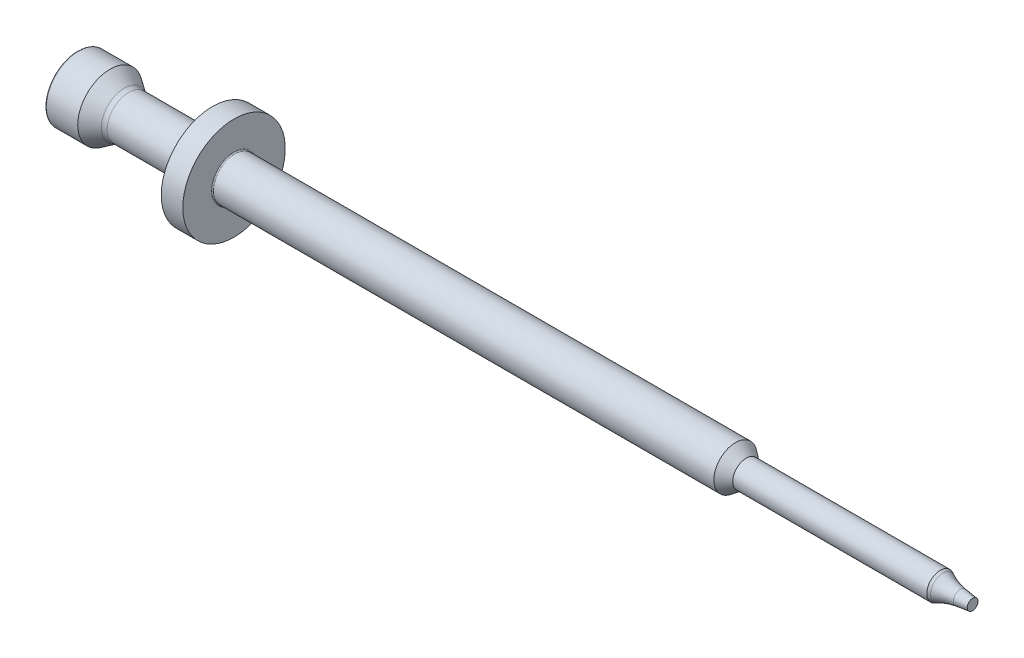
ISO-10303-21;
HEADER;
FILE_DESCRIPTION(('STEP AP214'),'2;1');
FILE_NAME('part.step','',(''),(''),'','','');
FILE_SCHEMA(('AUTOMOTIVE_DESIGN { 1 0 10303 214 1 1 1 1 }'));
ENDSEC;
DATA;
#1=APPLICATION_CONTEXT('core data for automotive mechanical design processes');
#2=APPLICATION_PROTOCOL_DEFINITION('international standard','automotive_design',2000,#1);
#3=PRODUCT_CONTEXT('',#1,'mechanical');
#4=PRODUCT('Part','Part','',(#3));
#5=PRODUCT_RELATED_PRODUCT_CATEGORY('part','',(#4));
#6=PRODUCT_DEFINITION_FORMATION('','',#4);
#7=PRODUCT_DEFINITION_CONTEXT('part definition',#1,'design');
#8=PRODUCT_DEFINITION('design','',#6,#7);
#9=PRODUCT_DEFINITION_SHAPE('','',#8);
#10=(LENGTH_UNIT() NAMED_UNIT(*) SI_UNIT(.MILLI.,.METRE.));
#11=(NAMED_UNIT(*) PLANE_ANGLE_UNIT() SI_UNIT($,.RADIAN.));
#12=(NAMED_UNIT(*) SI_UNIT($,.STERADIAN.) SOLID_ANGLE_UNIT());
#13=UNCERTAINTY_MEASURE_WITH_UNIT(LENGTH_MEASURE(1.E-05),#10,'distance_accuracy_value','');
#14=(GEOMETRIC_REPRESENTATION_CONTEXT(3) GLOBAL_UNCERTAINTY_ASSIGNED_CONTEXT((#13)) GLOBAL_UNIT_ASSIGNED_CONTEXT((#10,
#11,#12)) REPRESENTATION_CONTEXT('',''));
#15=CARTESIAN_POINT('',(0.,0.,0.));
#16=DIRECTION('',(0.,0.,1.));
#17=DIRECTION('',(1.,0.,0.));
#18=AXIS2_PLACEMENT_3D('',#15,#16,#17);
#19=CARTESIAN_POINT('',(0.,0.,0.));
#20=DIRECTION('',(1.,0.,0.));
#21=DIRECTION('',(0.,0.,-1.));
#22=AXIS2_PLACEMENT_3D('',#19,#20,#21);
#23=PLANE('',#22);
#24=CARTESIAN_POINT('',(0.,0.,0.));
#25=DIRECTION('',(1.,0.,0.));
#26=DIRECTION('',(0.,0.,-1.));
#27=AXIS2_PLACEMENT_3D('',#24,#25,#26);
#28=CIRCLE('',#27,2.9);
#29=CARTESIAN_POINT('',(0.,0.,-2.9));
#30=VERTEX_POINT('',#29);
#31=EDGE_CURVE('E35',#30,#30,#28,.F.);
#32=ORIENTED_EDGE('',*,*,#31,.T.);
#33=EDGE_LOOP('',(#32));
#34=FACE_BOUND('',#33,.T.);
#35=ADVANCED_FACE('F28',(#34),#23,.F.);
#36=CARTESIAN_POINT('',(0.,0.,0.));
#37=DIRECTION('',(-1.,0.,0.));
#38=DIRECTION('',(0.,0.,1.));
#39=AXIS2_PLACEMENT_3D('',#36,#37,#38);
#40=CYLINDRICAL_SURFACE('',#39,3.);
#41=CARTESIAN_POINT('',(0.1,0.,0.));
#42=DIRECTION('',(1.,0.,0.));
#43=DIRECTION('',(0.,0.,-1.));
#44=AXIS2_PLACEMENT_3D('',#41,#42,#43);
#45=CIRCLE('',#44,3.);
#46=CARTESIAN_POINT('',(0.1,0.,-3.));
#47=VERTEX_POINT('',#46);
#48=EDGE_CURVE('E10',#47,#47,#45,.T.);
#49=ORIENTED_EDGE('',*,*,#48,.T.);
#50=EDGE_LOOP('',(#49));
#51=FACE_BOUND('',#50,.T.);
#52=CARTESIAN_POINT('',(3.,0.,0.));
#53=DIRECTION('',(-1.,0.,0.));
#54=DIRECTION('',(0.,0.,1.));
#55=AXIS2_PLACEMENT_3D('',#52,#53,#54);
#56=CIRCLE('',#55,3.);
#57=CARTESIAN_POINT('',(3.,0.,3.));
#58=VERTEX_POINT('',#57);
#59=EDGE_CURVE('E66',#58,#58,#56,.T.);
#60=ORIENTED_EDGE('',*,*,#59,.T.);
#61=EDGE_LOOP('',(#60));
#62=FACE_BOUND('',#61,.T.);
#63=ADVANCED_FACE('F105',(#51,#62),#40,.T.);
#64=CARTESIAN_POINT('',(4.5,0.,0.));
#65=DIRECTION('',(-1.,0.,0.));
#66=DIRECTION('',(0.,0.,1.));
#67=AXIS2_PLACEMENT_3D('',#64,#65,#66);
#68=CONICAL_SURFACE('',#67,2.,0.588002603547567);
#69=CARTESIAN_POINT('',(4.31105658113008,0.,0.));
#70=DIRECTION('',(-1.,0.,0.));
#71=DIRECTION('',(0.,0.,1.));
#72=AXIS2_PLACEMENT_3D('',#69,#70,#71);
#73=CIRCLE('',#72,2.12596227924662);
#74=CARTESIAN_POINT('',(4.31105658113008,0.,2.12596227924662));
#75=VERTEX_POINT('',#74);
#76=EDGE_CURVE('E43',#75,#75,#73,.T.);
#77=ORIENTED_EDGE('',*,*,#76,.T.);
#78=EDGE_LOOP('',(#77));
#79=FACE_BOUND('',#78,.T.);
#80=ORIENTED_EDGE('',*,*,#59,.F.);
#81=EDGE_LOOP('',(#80));
#82=FACE_BOUND('',#81,.T.);
#83=ADVANCED_FACE('F110',(#79,#82),#68,.T.);
#84=CARTESIAN_POINT('',(0.,0.,0.));
#85=DIRECTION('',(-1.,0.,0.));
#86=DIRECTION('',(0.,0.,1.));
#87=AXIS2_PLACEMENT_3D('',#84,#85,#86);
#88=CYLINDRICAL_SURFACE('',#87,2.);
#89=CARTESIAN_POINT('',(4.727081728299,0.,0.));
#90=DIRECTION('',(-1.,0.,0.));
#91=DIRECTION('',(0.,0.,1.));
#92=AXIS2_PLACEMENT_3D('',#89,#90,#91);
#93=CIRCLE('',#92,2.);
#94=CARTESIAN_POINT('',(4.727081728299,0.,2.));
#95=VERTEX_POINT('',#94);
#96=EDGE_CURVE('E39',#95,#95,#93,.F.);
#97=ORIENTED_EDGE('',*,*,#96,.T.);
#98=EDGE_LOOP('',(#97));
#99=FACE_BOUND('',#98,.T.);
#100=CARTESIAN_POINT('',(11.75,0.,0.));
#101=DIRECTION('',(1.,0.,0.));
#102=DIRECTION('',(0.,0.,-1.));
#103=AXIS2_PLACEMENT_3D('',#100,#101,#102);
#104=CIRCLE('',#103,2.);
#105=CARTESIAN_POINT('',(11.75,0.,-2.));
#106=VERTEX_POINT('',#105);
#107=EDGE_CURVE('E51',#106,#106,#104,.F.);
#108=ORIENTED_EDGE('',*,*,#107,.T.);
#109=EDGE_LOOP('',(#108));
#110=FACE_BOUND('',#109,.T.);
#111=ADVANCED_FACE('F133',(#99,#110),#88,.T.);
#112=CARTESIAN_POINT('',(12.5,-2.,0.));
#113=DIRECTION('',(1.,0.,0.));
#114=DIRECTION('',(0.,0.,-1.));
#115=AXIS2_PLACEMENT_3D('',#112,#113,#114);
#116=PLANE('',#115);
#117=CARTESIAN_POINT('',(12.5,0.,0.));
#118=DIRECTION('',(1.,0.,0.));
#119=DIRECTION('',(0.,0.,-1.));
#120=AXIS2_PLACEMENT_3D('',#117,#118,#119);
#121=CIRCLE('',#120,2.75);
#122=CARTESIAN_POINT('',(12.5,0.,-2.75));
#123=VERTEX_POINT('',#122);
#124=EDGE_CURVE('E48',#123,#123,#121,.T.);
#125=ORIENTED_EDGE('',*,*,#124,.T.);
#126=EDGE_LOOP('',(#125));
#127=FACE_BOUND('',#126,.T.);
#128=CARTESIAN_POINT('',(12.5,0.,0.));
#129=DIRECTION('',(-1.,0.,0.));
#130=DIRECTION('',(0.,0.,1.));
#131=AXIS2_PLACEMENT_3D('',#128,#129,#130);
#132=CIRCLE('',#131,4.75);
#133=CARTESIAN_POINT('',(12.5,0.,4.75));
#134=VERTEX_POINT('',#133);
#135=EDGE_CURVE('E69',#134,#134,#132,.T.);
#136=ORIENTED_EDGE('',*,*,#135,.T.);
#137=EDGE_LOOP('',(#136));
#138=FACE_BOUND('',#137,.T.);
#139=ADVANCED_FACE('F139',(#127,#138),#116,.F.);
#140=CARTESIAN_POINT('',(0.,0.,0.));
#141=DIRECTION('',(-1.,0.,0.));
#142=DIRECTION('',(0.,0.,1.));
#143=AXIS2_PLACEMENT_3D('',#140,#141,#142);
#144=CYLINDRICAL_SURFACE('',#143,4.75);
#145=ORIENTED_EDGE('',*,*,#135,.F.);
#146=EDGE_LOOP('',(#145));
#147=FACE_BOUND('',#146,.T.);
#148=CARTESIAN_POINT('',(14.5,0.,0.));
#149=DIRECTION('',(-1.,0.,0.));
#150=DIRECTION('',(0.,0.,1.));
#151=AXIS2_PLACEMENT_3D('',#148,#149,#150);
#152=CIRCLE('',#151,4.75);
#153=CARTESIAN_POINT('',(14.5,0.,4.75));
#154=VERTEX_POINT('',#153);
#155=EDGE_CURVE('E72',#154,#154,#152,.T.);
#156=ORIENTED_EDGE('',*,*,#155,.T.);
#157=EDGE_LOOP('',(#156));
#158=FACE_BOUND('',#157,.T.);
#159=ADVANCED_FACE('F145',(#147,#158),#144,.T.);
#160=CARTESIAN_POINT('',(14.5,-4.75,0.));
#161=DIRECTION('',(-1.,0.,0.));
#162=DIRECTION('',(0.,0.,1.));
#163=AXIS2_PLACEMENT_3D('',#160,#161,#162);
#164=PLANE('',#163);
#165=CARTESIAN_POINT('',(14.5,0.,0.));
#166=DIRECTION('',(-1.,0.,0.));
#167=DIRECTION('',(0.,0.,1.));
#168=AXIS2_PLACEMENT_3D('',#165,#166,#167);
#169=CIRCLE('',#168,2.1);
#170=CARTESIAN_POINT('',(14.5,0.,2.1));
#171=VERTEX_POINT('',#170);
#172=EDGE_CURVE('E57',#171,#171,#169,.T.);
#173=ORIENTED_EDGE('',*,*,#172,.T.);
#174=EDGE_LOOP('',(#173));
#175=FACE_BOUND('',#174,.T.);
#176=ORIENTED_EDGE('',*,*,#155,.F.);
#177=EDGE_LOOP('',(#176));
#178=FACE_BOUND('',#177,.T.);
#179=ADVANCED_FACE('F149',(#175,#178),#164,.F.);
#180=CARTESIAN_POINT('',(0.,0.,0.));
#181=DIRECTION('',(-1.,0.,0.));
#182=DIRECTION('',(0.,0.,1.));
#183=AXIS2_PLACEMENT_3D('',#180,#181,#182);
#184=CYLINDRICAL_SURFACE('',#183,2.);
#185=CARTESIAN_POINT('',(14.6,0.,0.));
#186=DIRECTION('',(-1.,0.,0.));
#187=DIRECTION('',(0.,0.,1.));
#188=AXIS2_PLACEMENT_3D('',#185,#186,#187);
#189=CIRCLE('',#188,2.);
#190=CARTESIAN_POINT('',(14.6,0.,2.));
#191=VERTEX_POINT('',#190);
#192=EDGE_CURVE('E54',#191,#191,#189,.F.);
#193=ORIENTED_EDGE('',*,*,#192,.T.);
#194=EDGE_LOOP('',(#193));
#195=FACE_BOUND('',#194,.T.);
#196=CARTESIAN_POINT('',(61.,0.,0.));
#197=DIRECTION('',(-1.,0.,0.));
#198=DIRECTION('',(0.,0.,1.));
#199=AXIS2_PLACEMENT_3D('',#196,#197,#198);
#200=CIRCLE('',#199,2.);
#201=CARTESIAN_POINT('',(61.,0.,2.));
#202=VERTEX_POINT('',#201);
#203=EDGE_CURVE('E75',#202,#202,#200,.T.);
#204=ORIENTED_EDGE('',*,*,#203,.T.);
#205=EDGE_LOOP('',(#204));
#206=FACE_BOUND('',#205,.T.);
#207=ADVANCED_FACE('F153',(#195,#206),#184,.T.);
#208=CARTESIAN_POINT('',(62.,0.,0.));
#209=DIRECTION('',(-1.,0.,0.));
#210=DIRECTION('',(0.,0.,1.));
#211=AXIS2_PLACEMENT_3D('',#208,#209,#210);
#212=CONICAL_SURFACE('',#211,1.25,0.643501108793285);
#213=ORIENTED_EDGE('',*,*,#203,.F.);
#214=EDGE_LOOP('',(#213));
#215=FACE_BOUND('',#214,.T.);
#216=CARTESIAN_POINT('',(62.,0.,0.));
#217=DIRECTION('',(-1.,0.,0.));
#218=DIRECTION('',(0.,0.,1.));
#219=AXIS2_PLACEMENT_3D('',#216,#217,#218);
#220=CIRCLE('',#219,1.25);
#221=CARTESIAN_POINT('',(62.,0.,1.25));
#222=VERTEX_POINT('',#221);
#223=EDGE_CURVE('E78',#222,#222,#220,.T.);
#224=ORIENTED_EDGE('',*,*,#223,.T.);
#225=EDGE_LOOP('',(#224));
#226=FACE_BOUND('',#225,.T.);
#227=ADVANCED_FACE('F157',(#215,#226),#212,.T.);
#228=CARTESIAN_POINT('',(0.,0.,0.));
#229=DIRECTION('',(-1.,0.,0.));
#230=DIRECTION('',(0.,0.,1.));
#231=AXIS2_PLACEMENT_3D('',#228,#229,#230);
#232=CYLINDRICAL_SURFACE('',#231,1.25);
#233=ORIENTED_EDGE('',*,*,#223,.F.);
#234=EDGE_LOOP('',(#233));
#235=FACE_BOUND('',#234,.T.);
#236=CARTESIAN_POINT('',(80.,0.,0.));
#237=DIRECTION('',(-1.,0.,0.));
#238=DIRECTION('',(0.,0.,1.));
#239=AXIS2_PLACEMENT_3D('',#236,#237,#238);
#240=CIRCLE('',#239,1.25);
#241=CARTESIAN_POINT('',(80.,0.,1.25));
#242=VERTEX_POINT('',#241);
#243=EDGE_CURVE('E81',#242,#242,#240,.T.);
#244=ORIENTED_EDGE('',*,*,#243,.T.);
#245=EDGE_LOOP('',(#244));
#246=FACE_BOUND('',#245,.T.);
#247=ADVANCED_FACE('F161',(#235,#246),#232,.T.);
#248=CARTESIAN_POINT('',(81.,0.,0.));
#249=DIRECTION('',(-1.,0.,0.));
#250=DIRECTION('',(0.,0.,1.));
#251=AXIS2_PLACEMENT_3D('',#248,#249,#250);
#252=CONICAL_SURFACE('',#251,0.75,0.463647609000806);
#253=CARTESIAN_POINT('',(80.2339556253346,0.,0.));
#254=DIRECTION('',(-1.,0.,0.));
#255=DIRECTION('',(0.,0.,1.));
#256=AXIS2_PLACEMENT_3D('',#253,#254,#255);
#257=CIRCLE('',#256,1.13302218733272);
#258=CARTESIAN_POINT('',(80.2339556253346,0.,1.13302218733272));
#259=VERTEX_POINT('',#258);
#260=EDGE_CURVE('E63',#259,#259,#257,.T.);
#261=ORIENTED_EDGE('',*,*,#260,.T.);
#262=EDGE_LOOP('',(#261));
#263=FACE_BOUND('',#262,.T.);
#264=ORIENTED_EDGE('',*,*,#243,.F.);
#265=EDGE_LOOP('',(#264));
#266=FACE_BOUND('',#265,.T.);
#267=ADVANCED_FACE('F101',(#263,#266),#252,.T.);
#268=CARTESIAN_POINT('',(83.,0.,0.));
#269=DIRECTION('',(-1.,0.,0.));
#270=DIRECTION('',(0.,0.,1.));
#271=AXIS2_PLACEMENT_3D('',#268,#269,#270);
#272=CONICAL_SURFACE('',#271,0.5,0.12435499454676);
#273=CARTESIAN_POINT('',(81.8498499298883,0.,0.));
#274=DIRECTION('',(-1.,0.,0.));
#275=DIRECTION('',(0.,0.,1.));
#276=AXIS2_PLACEMENT_3D('',#273,#274,#275);
#277=CIRCLE('',#276,0.643768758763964);
#278=CARTESIAN_POINT('',(81.8498499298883,0.,0.643768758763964));
#279=VERTEX_POINT('',#278);
#280=EDGE_CURVE('E60',#279,#279,#277,.F.);
#281=ORIENTED_EDGE('',*,*,#280,.T.);
#282=EDGE_LOOP('',(#281));
#283=FACE_BOUND('',#282,.T.);
#284=CARTESIAN_POINT('',(83.,0.,0.));
#285=DIRECTION('',(-1.,0.,0.));
#286=DIRECTION('',(0.,0.,1.));
#287=AXIS2_PLACEMENT_3D('',#284,#285,#286);
#288=CIRCLE('',#287,0.5);
#289=CARTESIAN_POINT('',(83.,0.,0.5));
#290=VERTEX_POINT('',#289);
#291=EDGE_CURVE('E84',#290,#290,#288,.T.);
#292=ORIENTED_EDGE('',*,*,#291,.T.);
#293=EDGE_LOOP('',(#292));
#294=FACE_BOUND('',#293,.T.);
#295=ADVANCED_FACE('F88',(#283,#294),#272,.T.);
#296=CARTESIAN_POINT('',(83.,-0.5,0.));
#297=DIRECTION('',(-1.,0.,0.));
#298=DIRECTION('',(0.,0.,1.));
#299=AXIS2_PLACEMENT_3D('',#296,#297,#298);
#300=PLANE('',#299);
#301=ORIENTED_EDGE('',*,*,#291,.F.);
#302=EDGE_LOOP('',(#301));
#303=FACE_BOUND('',#302,.T.);
#304=ADVANCED_FACE('F90',(#303),#300,.F.);
#305=CARTESIAN_POINT('',(82.4700236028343,0.,0.));
#306=DIRECTION('',(-1.,0.,0.));
#307=DIRECTION('',(0.,0.,1.));
#308=AXIS2_PLACEMENT_3D('',#305,#306,#307);
#309=TOROIDAL_SURFACE('',#308,5.6051581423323,5.);
#310=ORIENTED_EDGE('',*,*,#280,.F.);
#311=EDGE_LOOP('',(#310));
#312=FACE_BOUND('',#311,.T.);
#313=ORIENTED_EDGE('',*,*,#260,.F.);
#314=EDGE_LOOP('',(#313));
#315=FACE_BOUND('',#314,.T.);
#316=ADVANCED_FACE('F92',(#312,#315),#309,.F.);
#317=CARTESIAN_POINT('',(14.6,0.,0.));
#318=DIRECTION('',(-1.,0.,0.));
#319=DIRECTION('',(0.,0.,1.));
#320=AXIS2_PLACEMENT_3D('',#317,#318,#319);
#321=TOROIDAL_SURFACE('',#320,2.1,0.1);
#322=ORIENTED_EDGE('',*,*,#192,.F.);
#323=EDGE_LOOP('',(#322));
#324=FACE_BOUND('',#323,.T.);
#325=ORIENTED_EDGE('',*,*,#172,.F.);
#326=EDGE_LOOP('',(#325));
#327=FACE_BOUND('',#326,.T.);
#328=ADVANCED_FACE('F98',(#324,#327),#321,.F.);
#329=CARTESIAN_POINT('',(11.75,0.,0.));
#330=DIRECTION('',(1.,0.,0.));
#331=DIRECTION('',(0.,0.,-1.));
#332=AXIS2_PLACEMENT_3D('',#329,#330,#331);
#333=TOROIDAL_SURFACE('',#332,2.75,0.75);
#334=ORIENTED_EDGE('',*,*,#124,.F.);
#335=EDGE_LOOP('',(#334));
#336=FACE_BOUND('',#335,.T.);
#337=ORIENTED_EDGE('',*,*,#107,.F.);
#338=EDGE_LOOP('',(#337));
#339=FACE_BOUND('',#338,.T.);
#340=ADVANCED_FACE('F116',(#336,#339),#333,.F.);
#341=CARTESIAN_POINT('',(4.727081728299,0.,0.));
#342=DIRECTION('',(-1.,0.,0.));
#343=DIRECTION('',(0.,0.,1.));
#344=AXIS2_PLACEMENT_3D('',#341,#342,#343);
#345=TOROIDAL_SURFACE('',#344,2.75,0.75);
#346=ORIENTED_EDGE('',*,*,#96,.F.);
#347=EDGE_LOOP('',(#346));
#348=FACE_BOUND('',#347,.T.);
#349=ORIENTED_EDGE('',*,*,#76,.F.);
#350=EDGE_LOOP('',(#349));
#351=FACE_BOUND('',#350,.T.);
#352=ADVANCED_FACE('F119',(#348,#351),#345,.F.);
#353=CARTESIAN_POINT('',(0.1,0.,0.));
#354=DIRECTION('',(1.,0.,0.));
#355=DIRECTION('',(0.,0.,-1.));
#356=AXIS2_PLACEMENT_3D('',#353,#354,#355);
#357=TOROIDAL_SURFACE('',#356,2.9,0.1);
#358=ORIENTED_EDGE('',*,*,#48,.F.);
#359=EDGE_LOOP('',(#358));
#360=FACE_BOUND('',#359,.T.);
#361=ORIENTED_EDGE('',*,*,#31,.F.);
#362=EDGE_LOOP('',(#361));
#363=FACE_BOUND('',#362,.T.);
#364=ADVANCED_FACE('F30',(#360,#363),#357,.T.);
#365=CLOSED_SHELL('',(#35,#63,#83,#111,#139,#159,#179,#207,#227,#247,#267,#295,#304,#316,#328,
#340,#352,#364));
#366=MANIFOLD_SOLID_BREP('B2',#365);
#367=ADVANCED_BREP_SHAPE_REPRESENTATION('',(#18,#366),#14);
#368=SHAPE_DEFINITION_REPRESENTATION(#9,#367);
ENDSEC;
END-ISO-10303-21;
